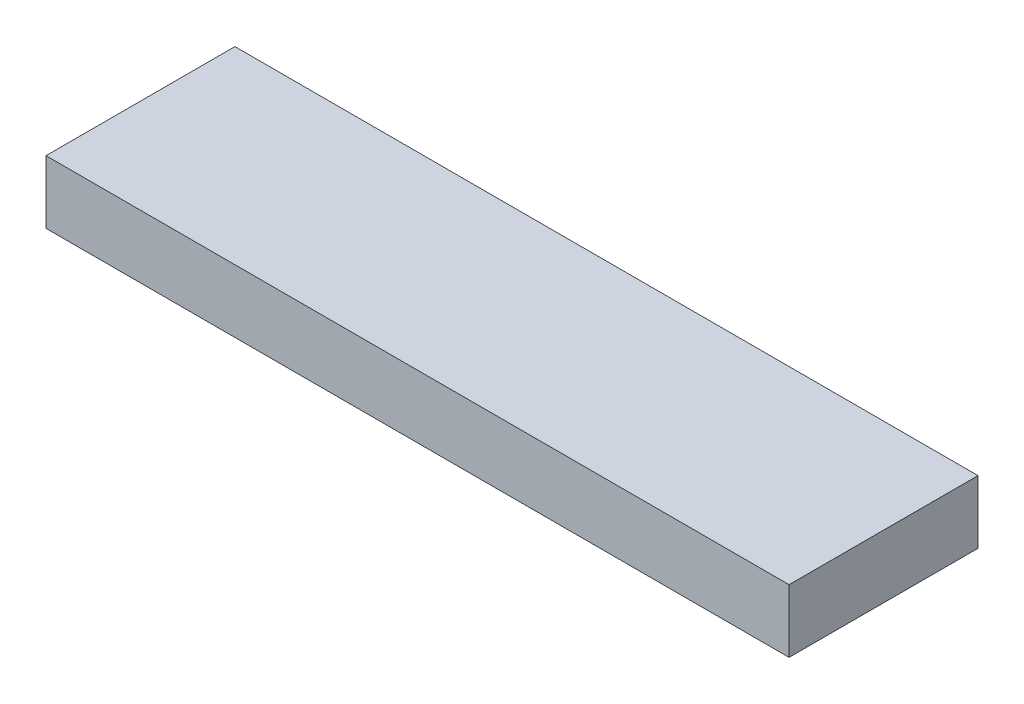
from build123d import *

# Parameters (mm, degrees)
ESQUISSE1_W        = 236
ESQUISSE1_H        = 60
BOSS_EXTRU_1_DEPTH = 20


with BuildPart() as part:
    # Esquisse1 → Boss.-Extru.1 (new body)
    with BuildSketch(Plane.XZ.offset(10)):
        Rectangle(ESQUISSE1_W, ESQUISSE1_H)
    extrude(amount=-BOSS_EXTRU_1_DEPTH)


solid = part.part
